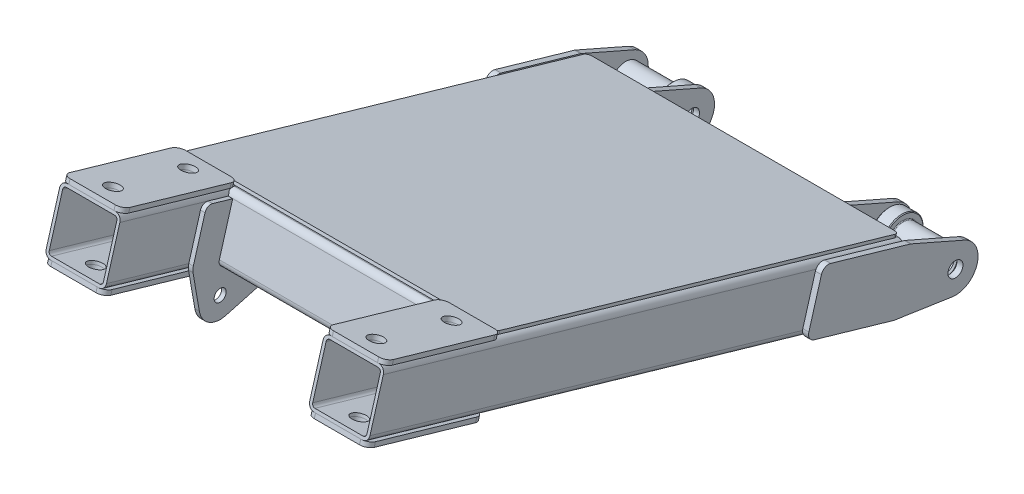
from build123d import *

# Parameters (mm, degrees)
BOSS_EXTRU_19_DEPTH      = 107.5
ENL_V_MAT_EXTRU_2_DEPTH  = 67.5
CONG_30_R                = 4
COQUE7_T                 = -2
BOSS_EXTRU_25_DEPTH      = 68.5
ESQUISSE34_R             = 4
BOSS_EXTRU_28_DEPTH      = 3
ESQUISSE102_R            = 5
BOSS_EXTRU_66_DEPTH      = 3
ESQUISSE103_R            = 5
BOSS_EXTRU_67_DEPTH      = 3
ESQUISSE104_R            = 5
BOSS_EXTRU_68_DEPTH      = 4
ESQUISSE105_R            = 5
BOSS_EXTRU_69_DEPTH      = 4
ESQUISSE113_R            = 5
ENL_V_MAT_EXTRU_29_DEPTH = 50
BOSS_EXTRU_72_DEPTH      = 2


with BuildPart() as part:
    # Esquisse23 → Boss.-Extru.19 (new body)
    with BuildSketch(Plane(origin=(0, 0, 0), x_dir=(0, 0, -1), z_dir=(1, 0, 0))):
        Polygon((69.851899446, 279.217831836), (414.736317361, 179.49077726), (403.625087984, 141.064997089), (58.740670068, 240.792051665), align=None)
    extrude(amount=BOSS_EXTRU_19_DEPTH)

    # Esquisse23_2 → Enl_v. mat.-Extru.2 (cut)
    with BuildSketch(Plane(origin=(0, 0, 0), x_dir=(0, 0, -1), z_dir=(1, 0, 0))):
        Polygon((69.851899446, 279.217831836), (414.736317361, 179.49077726), (403.625087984, 141.064997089), (58.740670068, 240.792051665), align=None)
    extrude(amount=ENL_V_MAT_EXTRU_2_DEPTH, mode=Mode.SUBTRACT)

    # Cong_30
    cong_30_edges = [part.edges().sort_by_distance(p)[0] for p in [
        (107.5, 229.354304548, -242.294108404),
        (67.5, 229.354304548, -242.294108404),
        (67.5, 190.928524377, -231.182879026),
        (107.5, 190.928524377, -231.182879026),
    ]]
    fillet(cong_30_edges, radius=CONG_30_R)

    # Coque7
    coque7_openings = [part.faces().sort_by_distance(p)[0] for p in [
        (87.5, 160.277887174, -409.180702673),
        (87.5, 260.004941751, -64.296284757),
    ]]
    offset(amount=COQUE7_T, openings=coque7_openings, kind=Kind.INTERSECTION)

    # Esquisse30 → Boss.-Extru.25 (add)
    # profile 1 of 2: a face of its own
    with BuildSketch(Plane(origin=(0, 0, 0), x_dir=(0, 0, -1), z_dir=(1, 0, 0))):
        with BuildLine():
            Line((145.742815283, 257.273153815), (176.483439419, 248.384170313))
            ThreePointArc((176.483439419, 248.384170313), (178.875112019, 246.473022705), (179.214894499, 243.430469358))
            Line((179.214894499, 243.430469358), (170.325910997, 212.689845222))
            ThreePointArc((170.325910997, 212.689845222), (168.414763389, 210.298172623), (165.372210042, 209.958390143))
            Line((165.372210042, 209.958390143), (134.631585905, 218.847373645))
            ThreePointArc((134.631585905, 218.847373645), (132.239913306, 220.758521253), (131.900130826, 223.801074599))
            Line((131.900130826, 223.801074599), (140.789114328, 254.541698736))
            ThreePointArc((140.789114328, 254.541698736), (142.700261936, 256.933371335), (145.742815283, 257.273153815))
        make_face()
        with BuildLine():
            Line((145.187253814, 255.351864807), (175.927877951, 246.462881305))
            ThreePointArc((175.927877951, 246.462881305), (177.12371425, 245.507307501), (177.29360549, 243.986030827))
            Line((177.29360549, 243.986030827), (168.404621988, 213.245406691))
            ThreePointArc((168.404621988, 213.245406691), (167.449048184, 212.049570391), (165.927771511, 211.879679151))
            Line((165.927771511, 211.879679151), (135.187147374, 220.768662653))
            ThreePointArc((135.187147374, 220.768662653), (133.991311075, 221.724236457), (133.821419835, 223.245513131))
            Line((133.821419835, 223.245513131), (142.710403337, 253.986137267))
            ThreePointArc((142.710403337, 253.986137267), (143.665977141, 255.181973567), (145.187253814, 255.351864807))
        make_face(mode=Mode.SUBTRACT)
    # profile 2 of 2: a face of its own
    with BuildSketch(Plane(origin=(0, 0, 0), x_dir=(0, 0, -1), z_dir=(1, 0, 0))):
        with BuildLine():
            Line((347.097540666, 161.574419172), (355.986524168, 192.315043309))
            ThreePointArc((355.986524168, 192.315043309), (355.646741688, 195.357596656), (353.255069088, 197.268744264))
            Line((353.255069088, 197.268744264), (322.514444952, 206.157727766))
            ThreePointArc((322.514444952, 206.157727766), (319.471891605, 205.817945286), (317.560743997, 203.426272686))
            Line((317.560743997, 203.426272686), (308.671760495, 172.68564855))
            ThreePointArc((308.671760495, 172.68564855), (309.011542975, 169.643095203), (311.403215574, 167.731947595))
            Line((311.403215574, 167.731947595), (342.143839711, 158.842964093))
            ThreePointArc((342.143839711, 158.842964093), (345.186393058, 159.182746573), (347.097540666, 161.574419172))
        make_face()
        with BuildLine():
            Line((345.176251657, 162.129980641), (354.065235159, 192.870604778))
            ThreePointArc((354.065235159, 192.870604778), (353.895343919, 194.391881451), (352.69950762, 195.347455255))
            Line((352.69950762, 195.347455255), (321.958883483, 204.236438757))
            ThreePointArc((321.958883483, 204.236438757), (320.43760681, 204.066547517), (319.482033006, 202.870711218))
            Line((319.482033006, 202.870711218), (310.593049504, 172.130087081))
            ThreePointArc((310.593049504, 172.130087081), (310.762940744, 170.608810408), (311.958777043, 169.653236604))
            Line((311.958777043, 169.653236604), (342.69940118, 160.764253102))
            ThreePointArc((342.69940118, 160.764253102), (344.220677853, 160.934144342), (345.176251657, 162.129980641))
        make_face(mode=Mode.SUBTRACT)
    extrude(amount=BOSS_EXTRU_25_DEPTH)

    # Esquisse113 → Enl_v. mat.-Extru.29 (cut)
    with BuildSketch(Plane(origin=(0, 279.194598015, -80.732133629), x_dir=(1, 0, 0), z_dir=(0, 0.96064450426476, -0.2777807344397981))):
        with Locations(Location((87.5, 3.541508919, 0), (0, 0, 270))):
            Circle(ESQUISSE113_R)
        with Locations(Location((87.5, 55.541508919, 0), (0, 0, 270))):
            Circle(ESQUISSE113_R)
    extrude(amount=-ENL_V_MAT_EXTRU_29_DEPTH, mode=Mode.SUBTRACT)


with BuildPart() as body_2:
    # Esquisse34 → Boss.-Extru.28 (new body)
    with BuildSketch(Plane(origin=(67.5, 0, 0), x_dir=(0, 0, -1), z_dir=(1, 0, 0))):
        with BuildLine():
            Line((134.559537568, 218.8682072), (165.44425838, 209.937556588))
            ThreePointArc((165.44425838, 209.937556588), (168.486811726, 210.277339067), (170.397959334, 212.669011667))
            Line((170.397959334, 212.669011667), (179.286942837, 243.409635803))
            Line((179.286942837, 243.409635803), (192.735965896, 239.520705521))
            ThreePointArc((192.735965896, 239.520705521), (195.127638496, 237.609557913), (195.467420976, 234.567004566))
            Line((195.467420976, 234.567004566), (187.689560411, 207.668958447))
            ThreePointArc((187.689560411, 207.668958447), (185.613497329, 204.186988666), (182.097111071, 202.169768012))
            Line((182.097111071, 202.169768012), (136.035786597, 189.685971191))
            ThreePointArc((136.035786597, 189.685971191), (124.852600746, 191.390211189), (118.579830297, 200.80405369))
            Line((118.579830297, 200.80405369), (114.339511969, 225.231469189))
            ThreePointArc((114.339511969, 225.231469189), (114.233648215, 227.037925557), (114.536481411, 228.821961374))
            Line((114.536481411, 228.821961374), (122.314341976, 255.720007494))
            ThreePointArc((122.314341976, 255.720007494), (124.225489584, 258.111680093), (127.268042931, 258.451462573))
            Line((127.268042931, 258.451462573), (140.71706599, 254.562532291))
            Line((140.71706599, 254.562532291), (131.828082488, 223.821908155))
            ThreePointArc((131.828082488, 223.821908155), (132.167864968, 220.779354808), (134.559537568, 218.8682072))
        make_face()
        with Locations((132.373549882, 203.198484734)):
            Circle(ESQUISSE34_R, mode=Mode.SUBTRACT)
    extrude(amount=-BOSS_EXTRU_28_DEPTH)


with BuildPart() as body_3:
    # Esquisse102 → Boss.-Extru.66 (new body)
    with BuildSketch(Plane(origin=(0, 276.312664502, -79.898791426), x_dir=(1, 0, 0), z_dir=(0, 0.9606445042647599, -0.27778073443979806))):
        with BuildLine():
            Line((72.5, -10.458491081), (102.5, -10.458491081))
            ThreePointArc((102.5, -10.458491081), (106.035533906, -8.994024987), (107.5, -5.458491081))
            Line((107.5, -5.458491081), (107.5, 64.541508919))
            ThreePointArc((107.5, 64.541508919), (106.035533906, 68.077042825), (102.5, 69.541508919))
            Line((102.5, 69.541508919), (72.5, 69.541508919))
            ThreePointArc((72.5, 69.541508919), (68.964466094, 68.077042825), (67.5, 64.541508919))
            Line((67.5, 64.541508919), (67.5, -5.458491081))
            ThreePointArc((67.5, -5.458491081), (68.964466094, -8.994024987), (72.5, -10.458491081))
        make_face()
        with Locations(Location((87.5, 55.541508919, 0), (0, 0, 90))):
            Circle(ESQUISSE102_R, mode=Mode.SUBTRACT)
        with Locations(Location((87.5, 3.541508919, 0), (0, 0, 90))):
            Circle(ESQUISSE102_R, mode=Mode.SUBTRACT)
    extrude(amount=BOSS_EXTRU_66_DEPTH)


with BuildPart() as body_4:
    # Esquisse103 → Boss.-Extru.67 (new body)
    with BuildSketch(Plane(origin=(0, 237.886884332, -68.787562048), x_dir=(1, 0, 0), z_dir=(0, -0.9606445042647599, 0.2777807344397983))):
        with BuildLine():
            Line((72.5, -69.541508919), (102.5, -69.541508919))
            ThreePointArc((102.5, -69.541508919), (106.035533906, -68.077042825), (107.5, -64.541508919))
            Line((107.5, -64.541508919), (107.5, 5.458491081))
            ThreePointArc((107.5, 5.458491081), (106.035533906, 8.994024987), (102.5, 10.458491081))
            Line((102.5, 10.458491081), (72.5, 10.458491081))
            ThreePointArc((72.5, 10.458491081), (68.964466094, 8.994024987), (67.5, 5.458491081))
            Line((67.5, 5.458491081), (67.5, -64.541508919))
            ThreePointArc((67.5, -64.541508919), (68.964466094, -68.077042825), (72.5, -69.541508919))
        make_face()
        with Locations(Location((87.5, -3.541508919, 0), (0, 0, 90))):
            Circle(ESQUISSE103_R, mode=Mode.SUBTRACT)
        with Locations(Location((87.5, -55.541508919, 0), (0, 0, 90))):
            Circle(ESQUISSE103_R, mode=Mode.SUBTRACT)
    extrude(amount=BOSS_EXTRU_67_DEPTH)


with BuildPart() as body_5:
    # Esquisse104 → Boss.-Extru.68 (new body)
    with BuildSketch(Plane(origin=(107.5, 0, 0), x_dir=(0, 0, -1), z_dir=(1, 0, 0))):
        with BuildLine():
            Line((361.900869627, 194.768717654), (414.736317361, 179.49077726))
            ThreePointArc((414.736317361, 179.49077726), (415.050056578, 179.38872557), (415.356382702, 179.266205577))
            Line((415.356382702, 179.266205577), (450.751456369, 163.735952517))
            ThreePointArc((450.751456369, 163.735952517), (459.134216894, 145.833288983), (442.490520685, 135.167295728))
            Line((442.490520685, 135.167295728), (404.269315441, 140.923984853))
            ThreePointArc((404.269315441, 140.923984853), (403.944874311, 140.983858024), (403.625087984, 141.064997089))
            Line((403.625087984, 141.064997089), (350.789640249, 156.342937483))
            ThreePointArc((350.789640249, 156.342937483), (347.8000495, 158.731871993), (347.3753214, 162.535063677))
            Line((347.3753214, 162.535063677), (355.708743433, 191.354398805))
            ThreePointArc((355.708743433, 191.354398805), (358.097677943, 194.343989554), (361.900869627, 194.768717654))
        make_face()
        with Locations((444.72454933, 150)):
            Circle(ESQUISSE104_R, mode=Mode.SUBTRACT)
    extrude(amount=BOSS_EXTRU_68_DEPTH)


with BuildPart() as body_6:
    # Esquisse105 → Boss.-Extru.69 (new body)
    with BuildSketch(Plane.ZY.offset(-67.5)):
        with BuildLine():
            Line((-361.900869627, 194.768717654), (-414.736317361, 179.49077726))
            ThreePointArc((-414.736317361, 179.49077726), (-415.050056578, 179.38872557), (-415.356382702, 179.266205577))
            Line((-415.356382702, 179.266205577), (-450.751456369, 163.735952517))
            ThreePointArc((-450.751456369, 163.735952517), (-459.134216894, 145.833288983), (-442.490520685, 135.167295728))
            Line((-442.490520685, 135.167295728), (-404.269315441, 140.923984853))
            ThreePointArc((-404.269315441, 140.923984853), (-403.944874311, 140.983858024), (-403.625087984, 141.064997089))
            Line((-403.625087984, 141.064997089), (-350.789640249, 156.342937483))
            ThreePointArc((-350.789640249, 156.342937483), (-347.8000495, 158.731871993), (-347.3753214, 162.535063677))
            Line((-347.3753214, 162.535063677), (-355.708743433, 191.354398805))
            ThreePointArc((-355.708743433, 191.354398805), (-358.097677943, 194.343989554), (-361.900869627, 194.768717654))
        make_face()
        with Locations((-444.72454933, 150)):
            Circle(ESQUISSE105_R, mode=Mode.SUBTRACT)
    extrude(amount=BOSS_EXTRU_69_DEPTH)


with BuildPart() as body_7:
    # Sym_trie10: mirrored copy
    add(part.part.mirror(Plane(origin=(0, 253.430575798, -144.631692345), x_dir=(0, 0, 1), z_dir=(1, 0, 0))))


with BuildPart() as body_8:
    # Sym_trie10 2: mirrored copy
    add(body_2.part.mirror(Plane(origin=(0, 253.430575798, -144.631692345), x_dir=(0, 0, 1), z_dir=(1, 0, 0))))


with BuildPart() as body_9:
    # Sym_trie10 3: mirrored copy
    add(body_6.part.mirror(Plane(origin=(0, 253.430575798, -144.631692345), x_dir=(0, 0, 1), z_dir=(1, 0, 0))))


with BuildPart() as body_10:
    # Sym_trie10 4: mirrored copy
    add(body_5.part.mirror(Plane(origin=(0, 253.430575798, -144.631692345), x_dir=(0, 0, 1), z_dir=(1, 0, 0))))


with BuildPart() as body_11:
    # Sym_trie10 5: mirrored copy
    add(body_3.part.mirror(Plane(origin=(0, 253.430575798, -144.631692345), x_dir=(0, 0, 1), z_dir=(1, 0, 0))))


with BuildPart() as body_12:
    # Sym_trie10 6: mirrored copy
    add(body_4.part.mirror(Plane(origin=(0, 253.430575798, -144.631692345), x_dir=(0, 0, 1), z_dir=(1, 0, 0))))


with BuildPart() as part_1:
    add(part.part)

    # Combiner3: union body 7
    add(body_7.part)


with BuildPart() as body_12_2:
    # Esquisse112 → Boss.-Extru.72 (new body)
    with BuildSketch(Plane(origin=(0, 276.312664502, -79.898791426), x_dir=(1, 0, 0), z_dir=(0, 0.9606445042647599, -0.27778073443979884))):
        with BuildLine():
            Line((100.5, 69.541508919), (-100.5, 69.541508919))
            ThreePointArc((-100.5, 69.541508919), (-102.621320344, 70.420188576), (-103.5, 72.541508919))
            Line((-103.5, 72.541508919), (-103.5, 345.55508406))
            ThreePointArc((-103.5, 345.55508406), (-102.621320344, 347.676404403), (-100.5, 348.55508406))
            Line((-100.5, 348.55508406), (100.5, 348.55508406))
            ThreePointArc((100.5, 348.55508406), (102.621320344, 347.676404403), (103.5, 345.55508406))
            Line((103.5, 345.55508406), (103.5, 72.541508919))
            ThreePointArc((103.5, 72.541508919), (102.621320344, 70.420188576), (100.5, 69.541508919))
        make_face()
    extrude(amount=BOSS_EXTRU_72_DEPTH)


with BuildPart() as body_13:
    # Esquisse119 → R_volution1 (revolve)
    with BuildSketch(Plane(origin=(0, 257.099774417, -74.343176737), x_dir=(1, 0, 0), z_dir=(0, -0.96064450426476, 0.2777807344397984)), mode=Mode.PRIVATE) as r_volution1_sk:
        with BuildLine():
            Line((105.5, -380.55508406), (68.5, -380.55508406))
            Line((68.5, -380.55508406), (67.5, -379.55508406))
            Line((67.5, -379.55508406), (67.5, -372.05508406))
            Line((67.5, -372.05508406), (68, -371.55508406))
            Line((68, -371.55508406), (76, -371.55508406))
            Line((76, -371.55508406), (76.5, -372.05508406))
            Line((76.5, -372.05508406), (76.5, -375.05508406))
            ThreePointArc((76.5, -375.05508406), (76.646446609, -375.40863745), (77, -375.55508406))
            Line((77, -375.55508406), (106, -375.55508406))
            Line((106, -375.55508406), (106.5, -376.05508406))
            Line((106.5, -376.05508406), (106.5, -379.55508406))
            Line((106.5, -379.55508406), (105.5, -380.55508406))
        make_face()
        with BuildLine():
            Line((-68.5, -380.55508406), (-67.5, -379.55508406))
            Line((-67.5, -379.55508406), (-67.5, -372.05508406))
            Line((-67.5, -372.05508406), (-68, -371.55508406))
            Line((-68, -371.55508406), (-76, -371.55508406))
            Line((-76, -371.55508406), (-76.5, -372.05508406))
            Line((-76.5, -372.05508406), (-76.5, -375.05508406))
            ThreePointArc((-76.5, -375.05508406), (-76.646446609, -375.40863745), (-77, -375.55508406))
            Line((-77, -375.55508406), (-107.5, -375.55508406))
            Line((-107.5, -375.55508406), (-108.002750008, -376.658496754))
            Line((-108.002750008, -376.658496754), (-108.002750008, -380.055091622))
            Line((-108.002750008, -380.055091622), (-107.5, -380.55508406))
            Line((-107.5, -380.55508406), (-68.5, -380.55508406))
        make_face()
    revolve(r_volution1_sk.sketch.rotate(Axis((107.5, 150, -444.72454933), (-1, 0, 0)), 163.872203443), axis=Axis((107.5, 150, -444.72454933), (-1, 0, 0)))


solid = Compound([body_2.part, body_3.part, body_4.part, body_5.part, body_6.part, body_8.part, body_9.part, body_10.part, body_11.part, body_12.part, part_1.part, body_12_2.part, body_13.part])
